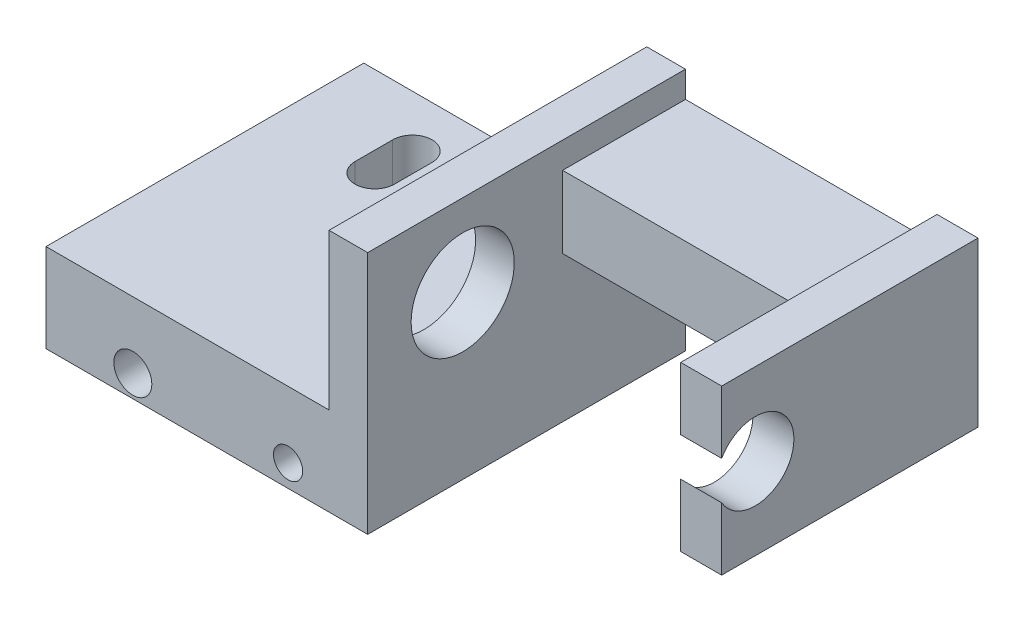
ISO-10303-21;
HEADER;
FILE_DESCRIPTION(('STEP AP214'),'2;1');
FILE_NAME('part.step','',(''),(''),'','','');
FILE_SCHEMA(('AUTOMOTIVE_DESIGN { 1 0 10303 214 1 1 1 1 }'));
ENDSEC;
DATA;
#1=APPLICATION_CONTEXT('core data for automotive mechanical design processes');
#2=APPLICATION_PROTOCOL_DEFINITION('international standard','automotive_design',2000,#1);
#3=PRODUCT_CONTEXT('',#1,'mechanical');
#4=PRODUCT('Part','Part','',(#3));
#5=PRODUCT_RELATED_PRODUCT_CATEGORY('part','',(#4));
#6=PRODUCT_DEFINITION_FORMATION('','',#4);
#7=PRODUCT_DEFINITION_CONTEXT('part definition',#1,'design');
#8=PRODUCT_DEFINITION('design','',#6,#7);
#9=PRODUCT_DEFINITION_SHAPE('','',#8);
#10=(LENGTH_UNIT() NAMED_UNIT(*) SI_UNIT(.MILLI.,.METRE.));
#11=(NAMED_UNIT(*) PLANE_ANGLE_UNIT() SI_UNIT($,.RADIAN.));
#12=(NAMED_UNIT(*) SI_UNIT($,.STERADIAN.) SOLID_ANGLE_UNIT());
#13=UNCERTAINTY_MEASURE_WITH_UNIT(LENGTH_MEASURE(1.E-05),#10,'distance_accuracy_value','');
#14=(GEOMETRIC_REPRESENTATION_CONTEXT(3) GLOBAL_UNCERTAINTY_ASSIGNED_CONTEXT((#13)) GLOBAL_UNIT_ASSIGNED_CONTEXT((#10,
#11,#12)) REPRESENTATION_CONTEXT('',''));
#15=CARTESIAN_POINT('',(0.,0.,0.));
#16=DIRECTION('',(0.,0.,1.));
#17=DIRECTION('',(1.,0.,0.));
#18=AXIS2_PLACEMENT_3D('',#15,#16,#17);
#19=CARTESIAN_POINT('',(-23.8125,18.923,12.319));
#20=DIRECTION('',(0.,1.,0.));
#21=DIRECTION('',(0.,0.,1.));
#22=AXIS2_PLACEMENT_3D('',#19,#20,#21);
#23=PLANE('',#22);
#24=DIRECTION('',(0.,0.,-1.));
#25=VECTOR('',#24,1.);
#26=CARTESIAN_POINT('',(-1.86690000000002,18.923,-12.319));
#27=LINE('',#26,#25);
#28=CARTESIAN_POINT('',(-1.86689999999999,18.9230000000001,12.319));
#29=VERTEX_POINT('',#28);
#30=CARTESIAN_POINT('',(-1.86690000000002,18.923,-12.319));
#31=VERTEX_POINT('',#30);
#32=EDGE_CURVE('E451',#29,#31,#27,.T.);
#33=ORIENTED_EDGE('',*,*,#32,.F.);
#34=DIRECTION('',(1.,0.,0.));
#35=VECTOR('',#34,1.);
#36=CARTESIAN_POINT('',(-23.8125,18.923,12.319));
#37=LINE('',#36,#35);
#38=CARTESIAN_POINT('',(1.13029999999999,18.923,12.319));
#39=VERTEX_POINT('',#38);
#40=EDGE_CURVE('E338',#29,#39,#37,.T.);
#41=ORIENTED_EDGE('',*,*,#40,.T.);
#42=DIRECTION('',(0.,0.,1.));
#43=VECTOR('',#42,1.);
#44=CARTESIAN_POINT('',(1.13029999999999,18.923,12.319));
#45=LINE('',#44,#43);
#46=CARTESIAN_POINT('',(1.13029999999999,18.923,-12.319));
#47=VERTEX_POINT('',#46);
#48=EDGE_CURVE('E600',#47,#39,#45,.T.);
#49=ORIENTED_EDGE('',*,*,#48,.F.);
#50=DIRECTION('',(-1.,0.,0.));
#51=VECTOR('',#50,1.);
#52=CARTESIAN_POINT('',(-23.8125,18.923,-12.319));
#53=LINE('',#52,#51);
#54=EDGE_CURVE('E628',#47,#31,#53,.T.);
#55=ORIENTED_EDGE('',*,*,#54,.T.);
#56=EDGE_LOOP('',(#33,#41,#49,#55));
#57=FACE_BOUND('',#56,.T.);
#58=ADVANCED_FACE('F44',(#57),#23,.T.);
#59=CARTESIAN_POINT('',(-23.8125,18.923,12.319));
#60=DIRECTION('',(0.,0.,-1.));
#61=DIRECTION('',(-1.,0.,0.));
#62=AXIS2_PLACEMENT_3D('',#59,#60,#61);
#63=PLANE('',#62);
#64=CARTESIAN_POINT('',(-17.0815,1.71450000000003,12.319));
#65=DIRECTION('',(0.,0.,1.));
#66=DIRECTION('',(1.,0.,0.));
#67=AXIS2_PLACEMENT_3D('',#64,#65,#66);
#68=CIRCLE('',#67,1.47319999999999);
#69=CARTESIAN_POINT('',(-15.6083,1.71450000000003,12.319));
#70=VERTEX_POINT('',#69);
#71=EDGE_CURVE('E387',#70,#70,#68,.T.);
#72=ORIENTED_EDGE('',*,*,#71,.F.);
#73=EDGE_LOOP('',(#72));
#74=FACE_BOUND('',#73,.T.);
#75=CARTESIAN_POINT('',(-5.04189999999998,1.7145,12.319));
#76=DIRECTION('',(0.,0.,1.));
#77=DIRECTION('',(1.,0.,0.));
#78=AXIS2_PLACEMENT_3D('',#75,#76,#77);
#79=CIRCLE('',#78,1.13029999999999);
#80=CARTESIAN_POINT('',(-3.9116,1.7145,12.319));
#81=VERTEX_POINT('',#80);
#82=EDGE_CURVE('E395',#81,#81,#79,.T.);
#83=ORIENTED_EDGE('',*,*,#82,.F.);
#84=EDGE_LOOP('',(#83));
#85=FACE_BOUND('',#84,.T.);
#86=ORIENTED_EDGE('',*,*,#40,.F.);
#87=DIRECTION('',(0.,-1.,0.));
#88=VECTOR('',#87,1.);
#89=CARTESIAN_POINT('',(-1.86689999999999,18.9230000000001,12.319));
#90=LINE('',#89,#88);
#91=CARTESIAN_POINT('',(-1.8669,6.85800000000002,12.319));
#92=VERTEX_POINT('',#91);
#93=EDGE_CURVE('E319',#29,#92,#90,.T.);
#94=ORIENTED_EDGE('',*,*,#93,.T.);
#95=DIRECTION('',(-1.,0.,0.));
#96=VECTOR('',#95,1.);
#97=CARTESIAN_POINT('',(-1.8669,6.85800000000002,12.319));
#98=LINE('',#97,#96);
#99=CARTESIAN_POINT('',(-23.8125,6.85800000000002,12.319));
#100=VERTEX_POINT('',#99);
#101=EDGE_CURVE('E327',#92,#100,#98,.T.);
#102=ORIENTED_EDGE('',*,*,#101,.T.);
#103=DIRECTION('',(0.,-1.,0.));
#104=VECTOR('',#103,1.);
#105=CARTESIAN_POINT('',(-23.8125,18.923,12.319));
#106=LINE('',#105,#104);
#107=CARTESIAN_POINT('',(-23.8125,0.,12.319));
#108=VERTEX_POINT('',#107);
#109=EDGE_CURVE('E651',#100,#108,#106,.T.);
#110=ORIENTED_EDGE('',*,*,#109,.T.);
#111=DIRECTION('',(1.,0.,0.));
#112=VECTOR('',#111,1.);
#113=CARTESIAN_POINT('',(-23.8125,0.,12.319));
#114=LINE('',#113,#112);
#115=CARTESIAN_POINT('',(1.13030000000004,0.,12.319));
#116=VERTEX_POINT('',#115);
#117=EDGE_CURVE('E637',#108,#116,#114,.T.);
#118=ORIENTED_EDGE('',*,*,#117,.T.);
#119=DIRECTION('',(0.,1.,0.));
#120=VECTOR('',#119,1.);
#121=CARTESIAN_POINT('',(1.13030000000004,0.,12.319));
#122=LINE('',#121,#120);
#123=EDGE_CURVE('E604',#116,#39,#122,.T.);
#124=ORIENTED_EDGE('',*,*,#123,.T.);
#125=EDGE_LOOP('',(#86,#94,#102,#110,#118,#124));
#126=FACE_BOUND('',#125,.T.);
#127=ADVANCED_FACE('F336',(#74,#85,#126),#63,.F.);
#128=CARTESIAN_POINT('',(-23.8125,18.923,-12.319));
#129=DIRECTION('',(1.,0.,0.));
#130=DIRECTION('',(0.,0.,-1.));
#131=AXIS2_PLACEMENT_3D('',#128,#129,#130);
#132=PLANE('',#131);
#133=ORIENTED_EDGE('',*,*,#109,.F.);
#134=DIRECTION('',(0.,0.,-1.));
#135=VECTOR('',#134,1.);
#136=CARTESIAN_POINT('',(-23.8125,6.85800000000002,12.319));
#137=LINE('',#136,#135);
#138=CARTESIAN_POINT('',(-23.8125,6.858,-12.319));
#139=VERTEX_POINT('',#138);
#140=EDGE_CURVE('E326',#100,#139,#137,.T.);
#141=ORIENTED_EDGE('',*,*,#140,.T.);
#142=DIRECTION('',(0.,-1.,0.));
#143=VECTOR('',#142,1.);
#144=CARTESIAN_POINT('',(-23.8125,18.923,-12.319));
#145=LINE('',#144,#143);
#146=CARTESIAN_POINT('',(-23.8125,0.,-12.319));
#147=VERTEX_POINT('',#146);
#148=EDGE_CURVE('E633',#139,#147,#145,.T.);
#149=ORIENTED_EDGE('',*,*,#148,.T.);
#150=DIRECTION('',(0.,0.,1.));
#151=VECTOR('',#150,1.);
#152=CARTESIAN_POINT('',(-23.8125,0.,-12.319));
#153=LINE('',#152,#151);
#154=EDGE_CURVE('E615',#147,#108,#153,.T.);
#155=ORIENTED_EDGE('',*,*,#154,.T.);
#156=EDGE_LOOP('',(#133,#141,#149,#155));
#157=FACE_BOUND('',#156,.T.);
#158=ADVANCED_FACE('F46',(#157),#132,.F.);
#159=CARTESIAN_POINT('',(23.8125,18.923,-12.319));
#160=DIRECTION('',(-1.,0.,0.));
#161=DIRECTION('',(0.,0.,1.));
#162=AXIS2_PLACEMENT_3D('',#159,#160,#161);
#163=PLANE('',#162);
#164=DIRECTION('',(0.,0.,-1.));
#165=VECTOR('',#164,1.);
#166=CARTESIAN_POINT('',(23.8125,18.923,-12.319));
#167=LINE('',#166,#165);
#168=CARTESIAN_POINT('',(23.8125,18.923,7.55650000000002));
#169=VERTEX_POINT('',#168);
#170=CARTESIAN_POINT('',(23.8125,18.923,-12.319));
#171=VERTEX_POINT('',#170);
#172=EDGE_CURVE('E624',#169,#171,#167,.T.);
#173=ORIENTED_EDGE('',*,*,#172,.F.);
#174=DIRECTION('',(0.,1.,0.));
#175=VECTOR('',#174,1.);
#176=CARTESIAN_POINT('',(23.8125,19.1150373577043,7.5565));
#177=LINE('',#176,#175);
#178=CARTESIAN_POINT('',(23.8125,14.0630428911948,7.55649999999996));
#179=VERTEX_POINT('',#178);
#180=EDGE_CURVE('E371',#179,#169,#177,.T.);
#181=ORIENTED_EDGE('',*,*,#180,.F.);
#182=CARTESIAN_POINT('',(23.8125,12.573,4.95299999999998));
#183=DIRECTION('',(1.,0.,0.));
#184=DIRECTION('',(0.,0.,-1.));
#185=AXIS2_PLACEMENT_3D('',#182,#183,#184);
#186=CIRCLE('',#185,2.99974);
#187=CARTESIAN_POINT('',(23.8125,11.0829571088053,7.55649999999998));
#188=VERTEX_POINT('',#187);
#189=EDGE_CURVE('E476',#188,#179,#186,.T.);
#190=ORIENTED_EDGE('',*,*,#189,.F.);
#191=CARTESIAN_POINT('',(23.8125,6.22300000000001,7.55650000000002));
#192=VERTEX_POINT('',#191);
#193=EDGE_CURVE('E377',#192,#188,#177,.T.);
#194=ORIENTED_EDGE('',*,*,#193,.F.);
#195=DIRECTION('',(0.,0.,-1.));
#196=VECTOR('',#195,1.);
#197=CARTESIAN_POINT('',(23.8125,6.22300000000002,12.319));
#198=LINE('',#197,#196);
#199=CARTESIAN_POINT('',(23.8125,6.22300000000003,-12.319));
#200=VERTEX_POINT('',#199);
#201=EDGE_CURVE('E585',#192,#200,#198,.T.);
#202=ORIENTED_EDGE('',*,*,#201,.T.);
#203=DIRECTION('',(0.,-1.,0.));
#204=VECTOR('',#203,1.);
#205=CARTESIAN_POINT('',(23.8125,18.923,-12.319));
#206=LINE('',#205,#204);
#207=EDGE_CURVE('E647',#171,#200,#206,.T.);
#208=ORIENTED_EDGE('',*,*,#207,.F.);
#209=EDGE_LOOP('',(#173,#181,#190,#194,#202,#208));
#210=FACE_BOUND('',#209,.T.);
#211=ADVANCED_FACE('F762',(#210),#163,.F.);
#212=CARTESIAN_POINT('',(-23.8125,18.923,-12.319));
#213=DIRECTION('',(0.,0.,1.));
#214=DIRECTION('',(1.,0.,0.));
#215=AXIS2_PLACEMENT_3D('',#212,#213,#214);
#216=PLANE('',#215);
#217=DIRECTION('',(-1.,0.,0.));
#218=VECTOR('',#217,1.);
#219=CARTESIAN_POINT('',(-1.86689999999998,6.85799999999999,-12.319));
#220=LINE('',#219,#218);
#221=CARTESIAN_POINT('',(-1.86689999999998,6.85799999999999,-12.319));
#222=VERTEX_POINT('',#221);
#223=EDGE_CURVE('E340',#222,#139,#220,.T.);
#224=ORIENTED_EDGE('',*,*,#223,.F.);
#225=DIRECTION('',(0.,1.,0.));
#226=VECTOR('',#225,1.);
#227=CARTESIAN_POINT('',(-1.8669,8.76300000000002,-12.319));
#228=LINE('',#227,#226);
#229=EDGE_CURVE('E322',#222,#31,#228,.T.);
#230=ORIENTED_EDGE('',*,*,#229,.T.);
#231=ORIENTED_EDGE('',*,*,#54,.F.);
#232=DIRECTION('',(0.,1.,0.));
#233=VECTOR('',#232,1.);
#234=CARTESIAN_POINT('',(1.13029999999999,18.923,-12.319));
#235=LINE('',#234,#233);
#236=CARTESIAN_POINT('',(1.13029999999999,16.891,-12.319));
#237=VERTEX_POINT('',#236);
#238=EDGE_CURVE('E527',#237,#47,#235,.T.);
#239=ORIENTED_EDGE('',*,*,#238,.F.);
#240=DIRECTION('',(-1.,0.,0.));
#241=VECTOR('',#240,1.);
#242=CARTESIAN_POINT('',(1.13029999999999,16.891,-12.319));
#243=LINE('',#242,#241);
#244=CARTESIAN_POINT('',(20.6375,16.891,-12.319));
#245=VERTEX_POINT('',#244);
#246=EDGE_CURVE('E554',#245,#237,#243,.T.);
#247=ORIENTED_EDGE('',*,*,#246,.F.);
#248=DIRECTION('',(0.,-1.,0.));
#249=VECTOR('',#248,1.);
#250=CARTESIAN_POINT('',(20.6375,18.923,-12.319));
#251=LINE('',#250,#249);
#252=CARTESIAN_POINT('',(20.6375,18.923,-12.319));
#253=VERTEX_POINT('',#252);
#254=EDGE_CURVE('E550',#253,#245,#251,.T.);
#255=ORIENTED_EDGE('',*,*,#254,.F.);
#256=EDGE_CURVE('E629',#171,#253,#53,.T.);
#257=ORIENTED_EDGE('',*,*,#256,.F.);
#258=ORIENTED_EDGE('',*,*,#207,.T.);
#259=DIRECTION('',(1.,0.,0.));
#260=VECTOR('',#259,1.);
#261=CARTESIAN_POINT('',(20.6375,6.22300000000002,-12.319));
#262=LINE('',#261,#260);
#263=CARTESIAN_POINT('',(20.6375,6.22300000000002,-12.319));
#264=VERTEX_POINT('',#263);
#265=EDGE_CURVE('E580',#264,#200,#262,.T.);
#266=ORIENTED_EDGE('',*,*,#265,.F.);
#267=DIRECTION('',(0.,-1.,0.));
#268=VECTOR('',#267,1.);
#269=CARTESIAN_POINT('',(20.6375,6.22300000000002,-12.319));
#270=LINE('',#269,#268);
#271=CARTESIAN_POINT('',(20.6375,11.303,-12.319));
#272=VERTEX_POINT('',#271);
#273=EDGE_CURVE('E576',#272,#264,#270,.T.);
#274=ORIENTED_EDGE('',*,*,#273,.F.);
#275=DIRECTION('',(1.,0.,0.));
#276=VECTOR('',#275,1.);
#277=CARTESIAN_POINT('',(1.1303,11.303,-12.319));
#278=LINE('',#277,#276);
#279=CARTESIAN_POINT('',(1.1303,11.303,-12.319));
#280=VERTEX_POINT('',#279);
#281=EDGE_CURVE('E572',#280,#272,#278,.T.);
#282=ORIENTED_EDGE('',*,*,#281,.F.);
#283=DIRECTION('',(0.,1.,0.));
#284=VECTOR('',#283,1.);
#285=CARTESIAN_POINT('',(1.13030000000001,0.,-12.319));
#286=LINE('',#285,#284);
#287=CARTESIAN_POINT('',(1.13030000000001,0.,-12.319));
#288=VERTEX_POINT('',#287);
#289=EDGE_CURVE('E568',#288,#280,#286,.T.);
#290=ORIENTED_EDGE('',*,*,#289,.F.);
#291=DIRECTION('',(-1.,0.,0.));
#292=VECTOR('',#291,1.);
#293=CARTESIAN_POINT('',(-23.8125,0.,-12.319));
#294=LINE('',#293,#292);
#295=CARTESIAN_POINT('',(-1.8669,0.,-12.319));
#296=VERTEX_POINT('',#295);
#297=EDGE_CURVE('E625',#288,#296,#294,.T.);
#298=ORIENTED_EDGE('',*,*,#297,.T.);
#299=DIRECTION('',(0.,-1.,0.));
#300=VECTOR('',#299,1.);
#301=CARTESIAN_POINT('',(-1.86689999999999,3.429,-12.319));
#302=LINE('',#301,#300);
#303=CARTESIAN_POINT('',(-1.86689999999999,3.429,-12.319));
#304=VERTEX_POINT('',#303);
#305=EDGE_CURVE('E541',#304,#296,#302,.T.);
#306=ORIENTED_EDGE('',*,*,#305,.F.);
#307=DIRECTION('',(1.,0.,0.));
#308=VECTOR('',#307,1.);
#309=CARTESIAN_POINT('',(-20.2565,3.42900000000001,-12.319));
#310=LINE('',#309,#308);
#311=CARTESIAN_POINT('',(-20.2565,3.42900000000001,-12.319));
#312=VERTEX_POINT('',#311);
#313=EDGE_CURVE('E485',#312,#304,#310,.T.);
#314=ORIENTED_EDGE('',*,*,#313,.F.);
#315=DIRECTION('',(0.,-1.,0.));
#316=VECTOR('',#315,1.);
#317=CARTESIAN_POINT('',(-20.2565,3.42900000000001,-12.319));
#318=LINE('',#317,#316);
#319=CARTESIAN_POINT('',(-20.2565,0.,-12.319));
#320=VERTEX_POINT('',#319);
#321=EDGE_CURVE('E506',#312,#320,#318,.T.);
#322=ORIENTED_EDGE('',*,*,#321,.T.);
#323=EDGE_CURVE('E641',#320,#147,#294,.T.);
#324=ORIENTED_EDGE('',*,*,#323,.T.);
#325=ORIENTED_EDGE('',*,*,#148,.F.);
#326=EDGE_LOOP('',(#224,#230,#231,#239,#247,#255,#257,#258,#266,#274,#282,#290,#298,#306,#314,
#322,#324,#325));
#327=FACE_BOUND('',#326,.T.);
#328=ADVANCED_FACE('F754',(#327),#216,.F.);
#329=DIRECTION('',(-1.,0.,0.));
#330=VECTOR('',#329,1.);
#331=CARTESIAN_POINT('',(-23.8125,18.923,7.55649999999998));
#332=LINE('',#331,#330);
#333=CARTESIAN_POINT('',(20.6375,18.923,7.55649999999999));
#334=VERTEX_POINT('',#333);
#335=EDGE_CURVE('E384',#169,#334,#332,.T.);
#336=ORIENTED_EDGE('',*,*,#335,.F.);
#337=ORIENTED_EDGE('',*,*,#172,.T.);
#338=ORIENTED_EDGE('',*,*,#256,.T.);
#339=DIRECTION('',(0.,0.,-1.));
#340=VECTOR('',#339,1.);
#341=CARTESIAN_POINT('',(20.6375,18.923,12.319));
#342=LINE('',#341,#340);
#343=EDGE_CURVE('E605',#334,#253,#342,.T.);
#344=ORIENTED_EDGE('',*,*,#343,.F.);
#345=EDGE_LOOP('',(#336,#337,#338,#344));
#346=FACE_BOUND('',#345,.T.);
#347=ADVANCED_FACE('F745',(#346),#23,.T.);
#348=CARTESIAN_POINT('',(-23.8125,0.,12.319));
#349=DIRECTION('',(0.,1.,0.));
#350=DIRECTION('',(0.,0.,1.));
#351=AXIS2_PLACEMENT_3D('',#348,#349,#350);
#352=PLANE('',#351);
#353=ORIENTED_EDGE('',*,*,#323,.F.);
#354=DIRECTION('',(0.,0.,-1.));
#355=VECTOR('',#354,1.);
#356=CARTESIAN_POINT('',(-20.2565,0.,-12.319));
#357=LINE('',#356,#355);
#358=CARTESIAN_POINT('',(-20.2565,0.,-1.34620000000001));
#359=VERTEX_POINT('',#358);
#360=EDGE_CURVE('E480',#359,#320,#357,.T.);
#361=ORIENTED_EDGE('',*,*,#360,.F.);
#362=CARTESIAN_POINT('',(-17.0815,0.,-1.34620000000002));
#363=DIRECTION('',(0.,-1.,0.));
#364=DIRECTION('',(0.,0.,1.));
#365=AXIS2_PLACEMENT_3D('',#362,#363,#364);
#366=CIRCLE('',#365,3.175);
#367=CARTESIAN_POINT('',(-17.0815,0.,1.8288));
#368=VERTEX_POINT('',#367);
#369=EDGE_CURVE('E486',#368,#359,#366,.T.);
#370=ORIENTED_EDGE('',*,*,#369,.F.);
#371=DIRECTION('',(-1.,0.,0.));
#372=VECTOR('',#371,1.);
#373=CARTESIAN_POINT('',(-17.0815,0.,1.8288));
#374=LINE('',#373,#372);
#375=CARTESIAN_POINT('',(-5.04189999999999,0.,1.8288));
#376=VERTEX_POINT('',#375);
#377=EDGE_CURVE('E517',#376,#368,#374,.T.);
#378=ORIENTED_EDGE('',*,*,#377,.F.);
#379=CARTESIAN_POINT('',(-5.04189999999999,0.,-1.3462));
#380=DIRECTION('',(0.,-1.,0.));
#381=DIRECTION('',(0.,0.,1.));
#382=AXIS2_PLACEMENT_3D('',#379,#380,#381);
#383=CIRCLE('',#382,3.175);
#384=CARTESIAN_POINT('',(-1.86689999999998,0.,-1.3462));
#385=VERTEX_POINT('',#384);
#386=EDGE_CURVE('E513',#385,#376,#383,.T.);
#387=ORIENTED_EDGE('',*,*,#386,.F.);
#388=DIRECTION('',(0.,0.,1.));
#389=VECTOR('',#388,1.);
#390=CARTESIAN_POINT('',(-1.8669,0.,-12.319));
#391=LINE('',#390,#389);
#392=EDGE_CURVE('E509',#296,#385,#391,.T.);
#393=ORIENTED_EDGE('',*,*,#392,.F.);
#394=ORIENTED_EDGE('',*,*,#297,.F.);
#395=DIRECTION('',(0.,0.,1.));
#396=VECTOR('',#395,1.);
#397=CARTESIAN_POINT('',(1.13030000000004,0.,12.319));
#398=LINE('',#397,#396);
#399=EDGE_CURVE('E601',#288,#116,#398,.T.);
#400=ORIENTED_EDGE('',*,*,#399,.T.);
#401=ORIENTED_EDGE('',*,*,#117,.F.);
#402=ORIENTED_EDGE('',*,*,#154,.F.);
#403=EDGE_LOOP('',(#353,#361,#370,#378,#387,#393,#394,#400,#401,#402));
#404=FACE_BOUND('',#403,.T.);
#405=ADVANCED_FACE('F753',(#404),#352,.F.);
#406=CARTESIAN_POINT('',(1.13030000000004,0.,12.319));
#407=DIRECTION('',(-1.,0.,0.));
#408=DIRECTION('',(0.,0.,1.));
#409=AXIS2_PLACEMENT_3D('',#406,#407,#408);
#410=PLANE('',#409);
#411=CARTESIAN_POINT('',(1.13029999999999,12.573,4.95299999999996));
#412=DIRECTION('',(-1.,0.,0.));
#413=DIRECTION('',(0.,0.,1.));
#414=AXIS2_PLACEMENT_3D('',#411,#412,#413);
#415=CIRCLE('',#414,3.99999999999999);
#416=CARTESIAN_POINT('',(1.13029999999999,12.573,8.95299999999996));
#417=VERTEX_POINT('',#416);
#418=EDGE_CURVE('E468',#417,#417,#415,.T.);
#419=ORIENTED_EDGE('',*,*,#418,.T.);
#420=EDGE_LOOP('',(#419));
#421=FACE_BOUND('',#420,.T.);
#422=DIRECTION('',(0.,1.,0.));
#423=VECTOR('',#422,1.);
#424=CARTESIAN_POINT('',(1.13029999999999,0.,-2.79400000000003));
#425=LINE('',#424,#423);
#426=CARTESIAN_POINT('',(1.13029999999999,11.303,-2.79399999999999));
#427=VERTEX_POINT('',#426);
#428=CARTESIAN_POINT('',(1.13029999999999,16.8910000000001,-2.79400000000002));
#429=VERTEX_POINT('',#428);
#430=EDGE_CURVE('E611',#427,#429,#425,.T.);
#431=ORIENTED_EDGE('',*,*,#430,.T.);
#432=DIRECTION('',(0.,0.,-1.));
#433=VECTOR('',#432,1.);
#434=CARTESIAN_POINT('',(1.1303,16.891,12.319));
#435=LINE('',#434,#433);
#436=EDGE_CURVE('E559',#429,#237,#435,.T.);
#437=ORIENTED_EDGE('',*,*,#436,.T.);
#438=ORIENTED_EDGE('',*,*,#238,.T.);
#439=ORIENTED_EDGE('',*,*,#48,.T.);
#440=ORIENTED_EDGE('',*,*,#123,.F.);
#441=ORIENTED_EDGE('',*,*,#399,.F.);
#442=ORIENTED_EDGE('',*,*,#289,.T.);
#443=DIRECTION('',(0.,0.,-1.));
#444=VECTOR('',#443,1.);
#445=CARTESIAN_POINT('',(1.13029999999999,11.303,12.319));
#446=LINE('',#445,#444);
#447=EDGE_CURVE('E584',#427,#280,#446,.T.);
#448=ORIENTED_EDGE('',*,*,#447,.F.);
#449=EDGE_LOOP('',(#431,#437,#438,#439,#440,#441,#442,#448));
#450=FACE_BOUND('',#449,.T.);
#451=ADVANCED_FACE('F760',(#421,#450),#410,.F.);
#452=CARTESIAN_POINT('',(1.13029999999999,0.,-2.79400000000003));
#453=DIRECTION('',(0.,0.,-1.));
#454=DIRECTION('',(-1.,0.,0.));
#455=AXIS2_PLACEMENT_3D('',#452,#453,#454);
#456=PLANE('',#455);
#457=DIRECTION('',(0.,1.,0.));
#458=VECTOR('',#457,1.);
#459=CARTESIAN_POINT('',(20.6375,0.,-2.79400000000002));
#460=LINE('',#459,#458);
#461=CARTESIAN_POINT('',(20.6375,11.303,-2.79399999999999));
#462=VERTEX_POINT('',#461);
#463=CARTESIAN_POINT('',(20.6375,16.8910000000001,-2.79400000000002));
#464=VERTEX_POINT('',#463);
#465=EDGE_CURVE('E616',#462,#464,#460,.T.);
#466=ORIENTED_EDGE('',*,*,#465,.T.);
#467=DIRECTION('',(-1.,0.,0.));
#468=VECTOR('',#467,1.);
#469=CARTESIAN_POINT('',(1.13029999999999,16.8910000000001,-2.79400000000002));
#470=LINE('',#469,#468);
#471=EDGE_CURVE('E562',#464,#429,#470,.T.);
#472=ORIENTED_EDGE('',*,*,#471,.T.);
#473=ORIENTED_EDGE('',*,*,#430,.F.);
#474=DIRECTION('',(1.,0.,0.));
#475=VECTOR('',#474,1.);
#476=CARTESIAN_POINT('',(1.13029999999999,11.303,-2.79399999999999));
#477=LINE('',#476,#475);
#478=EDGE_CURVE('E588',#427,#462,#477,.T.);
#479=ORIENTED_EDGE('',*,*,#478,.T.);
#480=EDGE_LOOP('',(#466,#472,#473,#479));
#481=FACE_BOUND('',#480,.T.);
#482=ADVANCED_FACE('F818',(#481),#456,.F.);
#483=CARTESIAN_POINT('',(20.6375,0.,12.319));
#484=DIRECTION('',(1.,0.,0.));
#485=DIRECTION('',(0.,0.,-1.));
#486=AXIS2_PLACEMENT_3D('',#483,#484,#485);
#487=PLANE('',#486);
#488=DIRECTION('',(0.,0.,-1.));
#489=VECTOR('',#488,1.);
#490=CARTESIAN_POINT('',(20.6375,6.22300000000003,12.319));
#491=LINE('',#490,#489);
#492=CARTESIAN_POINT('',(20.6375,6.22300000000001,7.55649999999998));
#493=VERTEX_POINT('',#492);
#494=EDGE_CURVE('E589',#493,#264,#491,.T.);
#495=ORIENTED_EDGE('',*,*,#494,.F.);
#496=DIRECTION('',(0.,1.,0.));
#497=VECTOR('',#496,1.);
#498=CARTESIAN_POINT('',(20.6375,19.1150373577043,7.55649999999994));
#499=LINE('',#498,#497);
#500=CARTESIAN_POINT('',(20.6375,11.0829571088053,7.55649999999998));
#501=VERTEX_POINT('',#500);
#502=EDGE_CURVE('E376',#493,#501,#499,.T.);
#503=ORIENTED_EDGE('',*,*,#502,.T.);
#504=CARTESIAN_POINT('',(20.6375,12.573,4.95300000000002));
#505=DIRECTION('',(1.,0.,0.));
#506=DIRECTION('',(0.,0.,-1.));
#507=AXIS2_PLACEMENT_3D('',#504,#505,#506);
#508=CIRCLE('',#507,2.99974);
#509=CARTESIAN_POINT('',(20.6375,14.0630428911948,7.55649999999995));
#510=VERTEX_POINT('',#509);
#511=EDGE_CURVE('E472',#510,#501,#508,.F.);
#512=ORIENTED_EDGE('',*,*,#511,.F.);
#513=EDGE_CURVE('E372',#510,#334,#499,.T.);
#514=ORIENTED_EDGE('',*,*,#513,.T.);
#515=ORIENTED_EDGE('',*,*,#343,.T.);
#516=ORIENTED_EDGE('',*,*,#254,.T.);
#517=DIRECTION('',(0.,0.,-1.));
#518=VECTOR('',#517,1.);
#519=CARTESIAN_POINT('',(20.6375,16.891,12.319));
#520=LINE('',#519,#518);
#521=EDGE_CURVE('E558',#464,#245,#520,.T.);
#522=ORIENTED_EDGE('',*,*,#521,.F.);
#523=ORIENTED_EDGE('',*,*,#465,.F.);
#524=DIRECTION('',(0.,0.,-1.));
#525=VECTOR('',#524,1.);
#526=CARTESIAN_POINT('',(20.6375,11.3030000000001,12.319));
#527=LINE('',#526,#525);
#528=EDGE_CURVE('E592',#462,#272,#527,.T.);
#529=ORIENTED_EDGE('',*,*,#528,.T.);
#530=ORIENTED_EDGE('',*,*,#273,.T.);
#531=EDGE_LOOP('',(#495,#503,#512,#514,#515,#516,#522,#523,#529,#530));
#532=FACE_BOUND('',#531,.T.);
#533=ADVANCED_FACE('F782',(#532),#487,.F.);
#534=CARTESIAN_POINT('',(1.13029999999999,11.303,12.319));
#535=DIRECTION('',(0.,1.,0.));
#536=DIRECTION('',(-1.,0.,0.));
#537=AXIS2_PLACEMENT_3D('',#534,#535,#536);
#538=PLANE('',#537);
#539=ORIENTED_EDGE('',*,*,#447,.T.);
#540=ORIENTED_EDGE('',*,*,#281,.T.);
#541=ORIENTED_EDGE('',*,*,#528,.F.);
#542=ORIENTED_EDGE('',*,*,#478,.F.);
#543=EDGE_LOOP('',(#539,#540,#541,#542));
#544=FACE_BOUND('',#543,.T.);
#545=ADVANCED_FACE('F822',(#544),#538,.F.);
#546=CARTESIAN_POINT('',(20.6375,6.22300000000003,12.319));
#547=DIRECTION('',(0.,1.,0.));
#548=DIRECTION('',(0.,0.,1.));
#549=AXIS2_PLACEMENT_3D('',#546,#547,#548);
#550=PLANE('',#549);
#551=ORIENTED_EDGE('',*,*,#201,.F.);
#552=DIRECTION('',(-1.,0.,0.));
#553=VECTOR('',#552,1.);
#554=CARTESIAN_POINT('',(20.6375,6.22300000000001,7.55649999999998));
#555=LINE('',#554,#553);
#556=EDGE_CURVE('E380',#192,#493,#555,.T.);
#557=ORIENTED_EDGE('',*,*,#556,.T.);
#558=ORIENTED_EDGE('',*,*,#494,.T.);
#559=ORIENTED_EDGE('',*,*,#265,.T.);
#560=EDGE_LOOP('',(#551,#557,#558,#559));
#561=FACE_BOUND('',#560,.T.);
#562=ADVANCED_FACE('F825',(#561),#550,.F.);
#563=CARTESIAN_POINT('',(1.1303,16.891,12.319));
#564=DIRECTION('',(0.,-1.,0.));
#565=DIRECTION('',(1.,0.,0.));
#566=AXIS2_PLACEMENT_3D('',#563,#564,#565);
#567=PLANE('',#566);
#568=ORIENTED_EDGE('',*,*,#521,.T.);
#569=ORIENTED_EDGE('',*,*,#246,.T.);
#570=ORIENTED_EDGE('',*,*,#436,.F.);
#571=ORIENTED_EDGE('',*,*,#471,.F.);
#572=EDGE_LOOP('',(#568,#569,#570,#571));
#573=FACE_BOUND('',#572,.T.);
#574=ADVANCED_FACE('F816',(#573),#567,.F.);
#575=CARTESIAN_POINT('',(-20.2565,3.42900000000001,-12.319));
#576=DIRECTION('',(-1.,0.,0.));
#577=DIRECTION('',(0.,0.,1.));
#578=AXIS2_PLACEMENT_3D('',#575,#576,#577);
#579=PLANE('',#578);
#580=ORIENTED_EDGE('',*,*,#360,.T.);
#581=ORIENTED_EDGE('',*,*,#321,.F.);
#582=DIRECTION('',(0.,0.,-1.));
#583=VECTOR('',#582,1.);
#584=CARTESIAN_POINT('',(-20.2565,3.42900000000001,-12.319));
#585=LINE('',#584,#583);
#586=CARTESIAN_POINT('',(-20.2565,3.42900000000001,-1.34620000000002));
#587=VERTEX_POINT('',#586);
#588=EDGE_CURVE('E481',#587,#312,#585,.T.);
#589=ORIENTED_EDGE('',*,*,#588,.F.);
#590=DIRECTION('',(0.,-1.,0.));
#591=VECTOR('',#590,1.);
#592=CARTESIAN_POINT('',(-20.2565,3.42900000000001,-1.34620000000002));
#593=LINE('',#592,#591);
#594=EDGE_CURVE('E524',#587,#359,#593,.T.);
#595=ORIENTED_EDGE('',*,*,#594,.T.);
#596=EDGE_LOOP('',(#580,#581,#589,#595));
#597=FACE_BOUND('',#596,.T.);
#598=ADVANCED_FACE('F733',(#597),#579,.F.);
#599=CARTESIAN_POINT('',(-17.0815,3.42900000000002,-1.34620000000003));
#600=DIRECTION('',(0.,-1.,0.));
#601=DIRECTION('',(0.,0.,-1.));
#602=AXIS2_PLACEMENT_3D('',#599,#600,#601);
#603=CYLINDRICAL_SURFACE('',#602,3.175);
#604=DIRECTION('',(0.,-1.,0.));
#605=VECTOR('',#604,1.);
#606=CARTESIAN_POINT('',(-17.0815,3.42900000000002,1.8288));
#607=LINE('',#606,#605);
#608=CARTESIAN_POINT('',(-17.0815,3.42900000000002,1.8288));
#609=VERTEX_POINT('',#608);
#610=CARTESIAN_POINT('',(-17.0815,3.18770000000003,1.82879999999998));
#611=VERTEX_POINT('',#610);
#612=EDGE_CURVE('E528',#609,#611,#607,.T.);
#613=ORIENTED_EDGE('',*,*,#612,.T.);
#614=CARTESIAN_POINT('',(-17.0815,3.18770000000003,1.82879999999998));
#615=CARTESIAN_POINT('',(-17.1207314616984,3.18770181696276,1.82880379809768));
#616=CARTESIAN_POINT('',(-17.1599423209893,3.18613183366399,1.82807204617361));
#617=CARTESIAN_POINT('',(-17.2380482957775,3.179882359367,1.82517838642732));
#618=CARTESIAN_POINT('',(-17.2769435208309,3.17520399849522,1.82301699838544));
#619=CARTESIAN_POINT('',(-17.392400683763,3.15661792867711,1.81447751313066));
#620=CARTESIAN_POINT('',(-17.46813173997,3.13815842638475,1.8060432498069));
#621=CARTESIAN_POINT('',(-17.6150199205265,3.08987602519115,1.78453541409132));
#622=CARTESIAN_POINT('',(-17.6861814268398,3.06006420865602,1.77146636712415));
#623=CARTESIAN_POINT('',(-17.8224995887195,2.99008355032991,1.74190857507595));
#624=CARTESIAN_POINT('',(-17.8876507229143,2.94990531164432,1.72541672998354));
#625=CARTESIAN_POINT('',(-18.0139383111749,2.85787548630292,1.68954115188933));
#626=CARTESIAN_POINT('',(-18.0746709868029,2.80551269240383,1.67004964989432));
#627=CARTESIAN_POINT('',(-18.1868521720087,2.69169269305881,1.63077156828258));
#628=CARTESIAN_POINT('',(-18.2382956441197,2.63023058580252,1.61098483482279));
#629=CARTESIAN_POINT('',(-18.3337442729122,2.49518499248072,1.57190557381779));
#630=CARTESIAN_POINT('',(-18.377057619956,2.42107596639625,1.55272681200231));
#631=CARTESIAN_POINT('',(-18.4504245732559,2.26562336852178,1.51881581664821));
#632=CARTESIAN_POINT('',(-18.480486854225,2.18428457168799,1.50408067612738));
#633=CARTESIAN_POINT('',(-18.524723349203,2.02133485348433,1.48192951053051));
#634=CARTESIAN_POINT('',(-18.5396863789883,1.93998930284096,1.47415283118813));
#635=CARTESIAN_POINT('',(-18.555742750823,1.77559816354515,1.4657965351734));
#636=CARTESIAN_POINT('',(-18.5568464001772,1.69255388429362,1.46521156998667));
#637=CARTESIAN_POINT('',(-18.5457364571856,1.53596985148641,1.47100777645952));
#638=CARTESIAN_POINT('',(-18.5348357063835,1.46230586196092,1.47670228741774));
#639=CARTESIAN_POINT('',(-18.5022686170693,1.31800523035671,1.49323153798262));
#640=CARTESIAN_POINT('',(-18.4805997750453,1.2473692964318,1.50406747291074));
#641=CARTESIAN_POINT('',(-18.4266863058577,1.10917096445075,1.52990957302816));
#642=CARTESIAN_POINT('',(-18.3942098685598,1.04171664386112,1.54500593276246));
#643=CARTESIAN_POINT('',(-18.3197716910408,0.912913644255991,1.57766010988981));
#644=CARTESIAN_POINT('',(-18.2778056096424,0.851567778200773,1.59521905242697));
#645=CARTESIAN_POINT('',(-18.1803216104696,0.729804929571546,1.6331003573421));
#646=CARTESIAN_POINT('',(-18.1238334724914,0.670191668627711,1.65351723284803));
#647=CARTESIAN_POINT('',(-18.0015106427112,0.560973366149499,1.69326363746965));
#648=CARTESIAN_POINT('',(-17.9356719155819,0.511372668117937,1.71259269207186));
#649=CARTESIAN_POINT('',(-17.7935508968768,0.421985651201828,1.74882338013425));
#650=CARTESIAN_POINT('',(-17.7169818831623,0.382607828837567,1.76561517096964));
#651=CARTESIAN_POINT('',(-17.5573652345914,0.317623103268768,1.79397712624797));
#652=CARTESIAN_POINT('',(-17.4743287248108,0.291993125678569,1.80555603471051));
#653=CARTESIAN_POINT('',(-17.3390155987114,0.263062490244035,1.81874689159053));
#654=CARTESIAN_POINT('',(-17.287934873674,0.254920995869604,1.82249675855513));
#655=CARTESIAN_POINT('',(-17.1850820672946,0.244034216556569,1.82753097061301));
#656=CARTESIAN_POINT('',(-17.1333099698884,0.241289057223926,1.82881525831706));
#657=CARTESIAN_POINT('',(-17.0815,0.241300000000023,1.82879999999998));
#658=B_SPLINE_CURVE_WITH_KNOTS('',3,(#614,#615,#616,#617,#618,#619,#620,#621,#622,#623,#624,
#625,#626,#627,#628,#629,#630,#631,#632,#633,#634,#635,#636,#637,#638,#639,#640,#641,#642,#643,
#644,#645,#646,#647,#648,#649,#650,#651,#652,#653,#654,#655,#656,#657),.UNSPECIFIED.,.F.,.F.,(4,
2,2,2,2,2,2,2,2,2,2,2,2,2,2,2,2,2,2,2,2,4),(0.,0.117616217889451,0.235189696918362,
0.469160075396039,0.702902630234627,0.936857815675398,1.18338307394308,1.4300416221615,
1.69257493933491,1.95493613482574,2.20274407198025,2.45036770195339,2.67337731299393,
2.89643879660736,3.12463139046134,3.35292858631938,3.60568575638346,3.85855233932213,
4.12034970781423,4.38170628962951,4.53697347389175,4.69224427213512),.UNSPECIFIED.);
#659=CARTESIAN_POINT('',(-17.0815,0.241300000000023,1.82879999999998));
#660=VERTEX_POINT('',#659);
#661=EDGE_CURVE('E663',#611,#660,#658,.T.);
#662=ORIENTED_EDGE('',*,*,#661,.T.);
#663=EDGE_CURVE('E532',#660,#368,#607,.T.);
#664=ORIENTED_EDGE('',*,*,#663,.T.);
#665=ORIENTED_EDGE('',*,*,#369,.T.);
#666=ORIENTED_EDGE('',*,*,#594,.F.);
#667=CARTESIAN_POINT('',(-17.0815,3.42900000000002,-1.34620000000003));
#668=DIRECTION('',(0.,-1.,0.));
#669=DIRECTION('',(0.,0.,1.));
#670=AXIS2_PLACEMENT_3D('',#667,#668,#669);
#671=CIRCLE('',#670,3.175);
#672=EDGE_CURVE('E502',#609,#587,#671,.T.);
#673=ORIENTED_EDGE('',*,*,#672,.F.);
#674=EDGE_LOOP('',(#613,#662,#664,#665,#666,#673));
#675=FACE_BOUND('',#674,.T.);
#676=ADVANCED_FACE('F729',(#675),#603,.F.);
#677=CARTESIAN_POINT('',(-17.0815,3.42900000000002,1.8288));
#678=DIRECTION('',(0.,0.,1.));
#679=DIRECTION('',(1.,0.,0.));
#680=AXIS2_PLACEMENT_3D('',#677,#678,#679);
#681=PLANE('',#680);
#682=ORIENTED_EDGE('',*,*,#663,.F.);
#683=CARTESIAN_POINT('',(-17.0815,1.71450000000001,1.82879999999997));
#684=DIRECTION('',(0.,0.,1.));
#685=DIRECTION('',(1.,0.,0.));
#686=AXIS2_PLACEMENT_3D('',#683,#684,#685);
#687=CIRCLE('',#686,1.47319999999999);
#688=EDGE_CURVE('E391',#660,#611,#687,.T.);
#689=ORIENTED_EDGE('',*,*,#688,.T.);
#690=ORIENTED_EDGE('',*,*,#612,.F.);
#691=DIRECTION('',(-1.,0.,0.));
#692=VECTOR('',#691,1.);
#693=CARTESIAN_POINT('',(-17.0815,3.42900000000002,1.8288));
#694=LINE('',#693,#692);
#695=CARTESIAN_POINT('',(-5.04189999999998,3.42900000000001,1.8288));
#696=VERTEX_POINT('',#695);
#697=EDGE_CURVE('E498',#696,#609,#694,.T.);
#698=ORIENTED_EDGE('',*,*,#697,.F.);
#699=DIRECTION('',(0.,-1.,0.));
#700=VECTOR('',#699,1.);
#701=CARTESIAN_POINT('',(-5.04189999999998,3.42900000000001,1.8288));
#702=LINE('',#701,#700);
#703=CARTESIAN_POINT('',(-5.04189999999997,2.84479999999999,1.82879999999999));
#704=VERTEX_POINT('',#703);
#705=EDGE_CURVE('E533',#696,#704,#702,.T.);
#706=ORIENTED_EDGE('',*,*,#705,.T.);
#707=CARTESIAN_POINT('',(-5.04189999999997,1.7145,1.82879999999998));
#708=DIRECTION('',(0.,0.,1.));
#709=DIRECTION('',(1.,0.,0.));
#710=AXIS2_PLACEMENT_3D('',#707,#708,#709);
#711=CIRCLE('',#710,1.13029999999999);
#712=CARTESIAN_POINT('',(-5.04189999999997,0.584200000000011,1.8288));
#713=VERTEX_POINT('',#712);
#714=EDGE_CURVE('E399',#704,#713,#711,.T.);
#715=ORIENTED_EDGE('',*,*,#714,.T.);
#716=EDGE_CURVE('E537',#713,#376,#702,.T.);
#717=ORIENTED_EDGE('',*,*,#716,.T.);
#718=ORIENTED_EDGE('',*,*,#377,.T.);
#719=EDGE_LOOP('',(#682,#689,#690,#698,#706,#715,#717,#718));
#720=FACE_BOUND('',#719,.T.);
#721=ADVANCED_FACE('F732',(#720),#681,.F.);
#722=CARTESIAN_POINT('',(-5.04189999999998,3.42900000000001,-1.34620000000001));
#723=DIRECTION('',(0.,-1.,0.));
#724=DIRECTION('',(0.,0.,-1.));
#725=AXIS2_PLACEMENT_3D('',#722,#723,#724);
#726=CYLINDRICAL_SURFACE('',#725,3.175);
#727=ORIENTED_EDGE('',*,*,#716,.F.);
#728=CARTESIAN_POINT('',(-5.04189999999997,0.584200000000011,1.8288));
#729=CARTESIAN_POINT('',(-5.0111275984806,0.584199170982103,1.82880240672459));
#730=CARTESIAN_POINT('',(-4.98037081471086,0.585457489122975,1.82835209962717));
#731=CARTESIAN_POINT('',(-4.91909465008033,0.590470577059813,1.82657180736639));
#732=CARTESIAN_POINT('',(-4.88857521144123,0.594224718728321,1.8252420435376));
#733=CARTESIAN_POINT('',(-4.79789092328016,0.609160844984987,1.81998528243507));
#734=CARTESIAN_POINT('',(-4.73836136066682,0.624016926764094,1.81479041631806));
#735=CARTESIAN_POINT('',(-4.62283231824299,0.662985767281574,1.8015606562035));
#736=CARTESIAN_POINT('',(-4.5668311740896,0.687094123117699,1.793527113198));
#737=CARTESIAN_POINT('',(-4.45964182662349,0.743813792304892,1.77542734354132));
#738=CARTESIAN_POINT('',(-4.40845641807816,0.776430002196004,1.76535994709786));
#739=CARTESIAN_POINT('',(-4.31040509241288,0.850554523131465,1.74380808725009));
#740=CARTESIAN_POINT('',(-4.26375171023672,0.892332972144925,1.73228648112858));
#741=CARTESIAN_POINT('',(-4.17794335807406,0.983024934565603,1.70931640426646));
#742=CARTESIAN_POINT('',(-4.13879061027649,1.03194055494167,1.69786795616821));
#743=CARTESIAN_POINT('',(-4.06780559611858,1.13752676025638,1.67591763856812));
#744=CARTESIAN_POINT('',(-4.03626370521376,1.19440278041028,1.66546053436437));
#745=CARTESIAN_POINT('',(-3.983287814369,1.31308185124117,1.64725213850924));
#746=CARTESIAN_POINT('',(-3.96184983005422,1.37488294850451,1.6394997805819));
#747=CARTESIAN_POINT('',(-3.93051195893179,1.49921432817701,1.62797427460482));
#748=CARTESIAN_POINT('',(-3.9202078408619,1.56162943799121,1.62406222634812));
#749=CARTESIAN_POINT('',(-3.91016606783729,1.68741719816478,1.62025158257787));
#750=CARTESIAN_POINT('',(-3.91042479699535,1.75078951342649,1.62035161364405));
#751=CARTESIAN_POINT('',(-3.92119049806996,1.87311376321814,1.62443329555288));
#752=CARTESIAN_POINT('',(-3.9311526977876,1.93212176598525,1.62820860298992));
#753=CARTESIAN_POINT('',(-3.9601473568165,2.04756539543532,1.63887493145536));
#754=CARTESIAN_POINT('',(-3.97918092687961,2.10400070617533,1.64576633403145));
#755=CARTESIAN_POINT('',(-4.02610360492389,2.21386764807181,1.66202312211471));
#756=CARTESIAN_POINT('',(-4.05414335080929,2.26722852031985,1.67143009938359));
#757=CARTESIAN_POINT('',(-4.11817789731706,2.36865231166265,1.69164254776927));
#758=CARTESIAN_POINT('',(-4.15417523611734,2.41671353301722,1.70244846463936));
#759=CARTESIAN_POINT('',(-4.2356495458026,2.50920768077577,1.72503336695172));
#760=CARTESIAN_POINT('',(-4.28156577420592,2.55324976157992,1.73683183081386));
#761=CARTESIAN_POINT('',(-4.38028279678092,2.63312512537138,1.75951231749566));
#762=CARTESIAN_POINT('',(-4.43308546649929,2.66895616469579,1.77039408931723));
#763=CARTESIAN_POINT('',(-4.54500439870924,2.73177357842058,1.79019764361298));
#764=CARTESIAN_POINT('',(-4.60419472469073,2.75863711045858,1.79909169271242));
#765=CARTESIAN_POINT('',(-4.72662039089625,2.80187084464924,1.81370567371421));
#766=CARTESIAN_POINT('',(-4.7898495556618,2.81825666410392,1.81943032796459));
#767=CARTESIAN_POINT('',(-4.88506853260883,2.83431056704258,1.8250777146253));
#768=CARTESIAN_POINT('',(-4.91630767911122,2.83824196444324,1.82646990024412));
#769=CARTESIAN_POINT('',(-4.97899217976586,2.84348528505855,1.82833166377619));
#770=CARTESIAN_POINT('',(-5.01043722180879,2.84480052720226,1.82880241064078));
#771=CARTESIAN_POINT('',(-5.04189999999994,2.84480000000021,1.82880000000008));
#772=B_SPLINE_CURVE_WITH_KNOTS('',3,(#728,#729,#730,#731,#732,#733,#734,#735,#736,#737,#738,
#739,#740,#741,#742,#743,#744,#745,#746,#747,#748,#749,#750,#751,#752,#753,#754,#755,#756,#757,
#758,#759,#760,#761,#762,#763,#764,#765,#766,#767,#768,#769,#770,#771),.UNSPECIFIED.,.F.,.F.,(4,
2,2,2,2,2,2,2,2,2,2,2,2,2,2,2,2,2,2,2,2,4),(0.,0.0922576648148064,0.18449211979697,
0.368254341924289,0.551929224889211,0.735710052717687,0.925891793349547,1.11612979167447,
1.31276371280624,1.50932002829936,1.69847182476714,1.88755887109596,2.06660795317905,
2.24567896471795,2.42791642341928,2.61021209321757,2.80344797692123,2.9967365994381,
3.19257366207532,3.38811813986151,3.48256067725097,3.57688332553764),.UNSPECIFIED.);
#773=EDGE_CURVE('E654',#713,#704,#772,.T.);
#774=ORIENTED_EDGE('',*,*,#773,.T.);
#775=ORIENTED_EDGE('',*,*,#705,.F.);
#776=CARTESIAN_POINT('',(-5.04189999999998,3.42900000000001,-1.34620000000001));
#777=DIRECTION('',(0.,-1.,0.));
#778=DIRECTION('',(0.,0.,1.));
#779=AXIS2_PLACEMENT_3D('',#776,#777,#778);
#780=CIRCLE('',#779,3.175);
#781=CARTESIAN_POINT('',(-1.8669,3.42900000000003,-1.34620000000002));
#782=VERTEX_POINT('',#781);
#783=EDGE_CURVE('E494',#782,#696,#780,.T.);
#784=ORIENTED_EDGE('',*,*,#783,.F.);
#785=DIRECTION('',(0.,-1.,0.));
#786=VECTOR('',#785,1.);
#787=CARTESIAN_POINT('',(-1.8669,3.42900000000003,-1.34620000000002));
#788=LINE('',#787,#786);
#789=EDGE_CURVE('E538',#782,#385,#788,.T.);
#790=ORIENTED_EDGE('',*,*,#789,.T.);
#791=ORIENTED_EDGE('',*,*,#386,.T.);
#792=EDGE_LOOP('',(#727,#774,#775,#784,#790,#791));
#793=FACE_BOUND('',#792,.T.);
#794=ADVANCED_FACE('F670',(#793),#726,.F.);
#795=CARTESIAN_POINT('',(-1.86689999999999,3.429,-12.319));
#796=DIRECTION('',(1.,0.,0.));
#797=DIRECTION('',(0.,0.,-1.));
#798=AXIS2_PLACEMENT_3D('',#795,#796,#797);
#799=PLANE('',#798);
#800=ORIENTED_EDGE('',*,*,#392,.T.);
#801=ORIENTED_EDGE('',*,*,#789,.F.);
#802=DIRECTION('',(0.,0.,1.));
#803=VECTOR('',#802,1.);
#804=CARTESIAN_POINT('',(-1.86689999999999,3.429,-12.319));
#805=LINE('',#804,#803);
#806=EDGE_CURVE('E490',#304,#782,#805,.T.);
#807=ORIENTED_EDGE('',*,*,#806,.F.);
#808=ORIENTED_EDGE('',*,*,#305,.T.);
#809=EDGE_LOOP('',(#800,#801,#807,#808));
#810=FACE_BOUND('',#809,.T.);
#811=ADVANCED_FACE('F727',(#810),#799,.F.);
#812=CARTESIAN_POINT('',(-17.0815,3.42900000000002,-1.34620000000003));
#813=DIRECTION('',(0.,1.,0.));
#814=DIRECTION('',(0.,0.,1.));
#815=AXIS2_PLACEMENT_3D('',#812,#813,#814);
#816=PLANE('',#815);
#817=DIRECTION('',(0.,0.,-1.));
#818=VECTOR('',#817,1.);
#819=CARTESIAN_POINT('',(-7.45743999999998,3.42900000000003,-5.37134617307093));
#820=LINE('',#819,#818);
#821=CARTESIAN_POINT('',(-7.45743999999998,3.42900000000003,-5.37134617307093));
#822=VERTEX_POINT('',#821);
#823=CARTESIAN_POINT('',(-7.45744,3.42899999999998,-8.29385382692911));
#824=VERTEX_POINT('',#823);
#825=EDGE_CURVE('E407',#822,#824,#820,.T.);
#826=ORIENTED_EDGE('',*,*,#825,.F.);
#827=CARTESIAN_POINT('',(-5.93343999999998,3.42900000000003,-5.37134617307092));
#828=DIRECTION('',(0.,-1.,0.));
#829=DIRECTION('',(0.,0.,-1.));
#830=AXIS2_PLACEMENT_3D('',#827,#828,#829);
#831=CIRCLE('',#830,1.524);
#832=CARTESIAN_POINT('',(-4.40943999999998,3.42900000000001,-5.37134617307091));
#833=VERTEX_POINT('',#832);
#834=EDGE_CURVE('E403',#833,#822,#831,.T.);
#835=ORIENTED_EDGE('',*,*,#834,.F.);
#836=DIRECTION('',(0.,0.,1.));
#837=VECTOR('',#836,1.);
#838=CARTESIAN_POINT('',(-4.40943999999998,3.42900000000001,-5.37134617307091));
#839=LINE('',#838,#837);
#840=CARTESIAN_POINT('',(-4.40943999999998,3.42899999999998,-8.29385382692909));
#841=VERTEX_POINT('',#840);
#842=EDGE_CURVE('E415',#841,#833,#839,.T.);
#843=ORIENTED_EDGE('',*,*,#842,.F.);
#844=CARTESIAN_POINT('',(-5.93343999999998,3.42899999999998,-8.29385382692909));
#845=DIRECTION('',(0.,-1.,0.));
#846=DIRECTION('',(0.,0.,-1.));
#847=AXIS2_PLACEMENT_3D('',#844,#845,#846);
#848=CIRCLE('',#847,1.524);
#849=EDGE_CURVE('E411',#824,#841,#848,.T.);
#850=ORIENTED_EDGE('',*,*,#849,.F.);
#851=EDGE_LOOP('',(#826,#835,#843,#850));
#852=FACE_BOUND('',#851,.T.);
#853=DIRECTION('',(0.,0.,-1.));
#854=VECTOR('',#853,1.);
#855=CARTESIAN_POINT('',(-17.54124,3.42900000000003,-5.37134617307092));
#856=LINE('',#855,#854);
#857=CARTESIAN_POINT('',(-17.54124,3.42900000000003,-5.37134617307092));
#858=VERTEX_POINT('',#857);
#859=CARTESIAN_POINT('',(-17.54124,3.42899999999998,-8.29385382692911));
#860=VERTEX_POINT('',#859);
#861=EDGE_CURVE('E435',#858,#860,#856,.T.);
#862=ORIENTED_EDGE('',*,*,#861,.F.);
#863=CARTESIAN_POINT('',(-16.01724,3.42900000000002,-5.3713461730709));
#864=DIRECTION('',(0.,-1.,0.));
#865=DIRECTION('',(0.,0.,-1.));
#866=AXIS2_PLACEMENT_3D('',#863,#864,#865);
#867=CIRCLE('',#866,1.524);
#868=CARTESIAN_POINT('',(-14.49324,3.42900000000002,-5.3713461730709));
#869=VERTEX_POINT('',#868);
#870=EDGE_CURVE('E423',#869,#858,#867,.T.);
#871=ORIENTED_EDGE('',*,*,#870,.F.);
#872=DIRECTION('',(0.,0.,1.));
#873=VECTOR('',#872,1.);
#874=CARTESIAN_POINT('',(-14.49324,3.42900000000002,-5.3713461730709));
#875=LINE('',#874,#873);
#876=CARTESIAN_POINT('',(-14.49324,3.42899999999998,-8.29385382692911));
#877=VERTEX_POINT('',#876);
#878=EDGE_CURVE('E443',#877,#869,#875,.T.);
#879=ORIENTED_EDGE('',*,*,#878,.F.);
#880=CARTESIAN_POINT('',(-16.01724,3.42899999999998,-8.29385382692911));
#881=DIRECTION('',(0.,-1.,0.));
#882=DIRECTION('',(0.,0.,-1.));
#883=AXIS2_PLACEMENT_3D('',#880,#881,#882);
#884=CIRCLE('',#883,1.524);
#885=EDGE_CURVE('E439',#860,#877,#884,.T.);
#886=ORIENTED_EDGE('',*,*,#885,.F.);
#887=EDGE_LOOP('',(#862,#871,#879,#886));
#888=FACE_BOUND('',#887,.T.);
#889=ORIENTED_EDGE('',*,*,#588,.T.);
#890=ORIENTED_EDGE('',*,*,#313,.T.);
#891=ORIENTED_EDGE('',*,*,#806,.T.);
#892=ORIENTED_EDGE('',*,*,#783,.T.);
#893=ORIENTED_EDGE('',*,*,#697,.T.);
#894=ORIENTED_EDGE('',*,*,#672,.T.);
#895=EDGE_LOOP('',(#889,#890,#891,#892,#893,#894));
#896=FACE_BOUND('',#895,.T.);
#897=ADVANCED_FACE('F724',(#852,#888,#896),#816,.F.);
#898=CARTESIAN_POINT('',(-23.8135,12.573,4.95299999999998));
#899=DIRECTION('',(1.,0.,0.));
#900=DIRECTION('',(0.,0.,-1.));
#901=AXIS2_PLACEMENT_3D('',#898,#899,#900);
#902=CYLINDRICAL_SURFACE('',#901,2.99974);
#903=ORIENTED_EDGE('',*,*,#189,.T.);
#904=DIRECTION('',(1.,0.,0.));
#905=VECTOR('',#904,1.);
#906=CARTESIAN_POINT('',(-23.8135,14.0630428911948,7.55649999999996));
#907=LINE('',#906,#905);
#908=EDGE_CURVE('E53',#179,#510,#907,.F.);
#909=ORIENTED_EDGE('',*,*,#908,.T.);
#910=ORIENTED_EDGE('',*,*,#511,.T.);
#911=DIRECTION('',(1.,0.,0.));
#912=VECTOR('',#911,1.);
#913=CARTESIAN_POINT('',(-23.8135,11.0829571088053,7.55649999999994));
#914=LINE('',#913,#912);
#915=EDGE_CURVE('E791',#501,#188,#914,.T.);
#916=ORIENTED_EDGE('',*,*,#915,.T.);
#917=EDGE_LOOP('',(#903,#909,#910,#916));
#918=FACE_BOUND('',#917,.T.);
#919=ADVANCED_FACE('F720',(#918),#902,.F.);
#920=CARTESIAN_POINT('',(-1.8669,12.573,4.95299999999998));
#921=DIRECTION('',(-1.,0.,0.));
#922=DIRECTION('',(0.,0.,1.));
#923=AXIS2_PLACEMENT_3D('',#920,#921,#922);
#924=PLANE('',#923);
#925=CARTESIAN_POINT('',(-1.8669,12.573,4.95299999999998));
#926=DIRECTION('',(-1.,0.,0.));
#927=DIRECTION('',(0.,0.,1.));
#928=AXIS2_PLACEMENT_3D('',#925,#926,#927);
#929=CIRCLE('',#928,3.99999999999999);
#930=CARTESIAN_POINT('',(-1.8669,12.573,8.95299999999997));
#931=VERTEX_POINT('',#930);
#932=EDGE_CURVE('E464',#931,#931,#929,.T.);
#933=ORIENTED_EDGE('',*,*,#932,.F.);
#934=EDGE_LOOP('',(#933));
#935=FACE_BOUND('',#934,.T.);
#936=ORIENTED_EDGE('',*,*,#93,.F.);
#937=ORIENTED_EDGE('',*,*,#32,.T.);
#938=ORIENTED_EDGE('',*,*,#229,.F.);
#939=DIRECTION('',(0.,0.,-1.));
#940=VECTOR('',#939,1.);
#941=CARTESIAN_POINT('',(-1.8669,6.85800000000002,12.319));
#942=LINE('',#941,#940);
#943=EDGE_CURVE('E315',#92,#222,#942,.T.);
#944=ORIENTED_EDGE('',*,*,#943,.F.);
#945=EDGE_LOOP('',(#936,#937,#938,#944));
#946=FACE_BOUND('',#945,.T.);
#947=ADVANCED_FACE('F317',(#935,#946),#924,.T.);
#948=CARTESIAN_POINT('',(-1.8669,12.573,4.95299999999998));
#949=DIRECTION('',(-1.,0.,0.));
#950=DIRECTION('',(0.,0.,1.));
#951=AXIS2_PLACEMENT_3D('',#948,#949,#950);
#952=CYLINDRICAL_SURFACE('',#951,3.99999999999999);
#953=ORIENTED_EDGE('',*,*,#418,.F.);
#954=EDGE_LOOP('',(#953));
#955=FACE_BOUND('',#954,.T.);
#956=ORIENTED_EDGE('',*,*,#932,.T.);
#957=EDGE_LOOP('',(#956));
#958=FACE_BOUND('',#957,.T.);
#959=ADVANCED_FACE('F713',(#955,#958),#952,.F.);
#960=CARTESIAN_POINT('',(-16.01724,18.923,-5.37134617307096));
#961=DIRECTION('',(0.,-1.,0.));
#962=DIRECTION('',(0.,0.,-1.));
#963=AXIS2_PLACEMENT_3D('',#960,#961,#962);
#964=CYLINDRICAL_SURFACE('',#963,1.524);
#965=DIRECTION('',(0.,-1.,0.));
#966=VECTOR('',#965,1.);
#967=CARTESIAN_POINT('',(-17.54124,18.923,-5.37134617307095));
#968=LINE('',#967,#966);
#969=CARTESIAN_POINT('',(-17.54124,6.85800000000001,-5.37134617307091));
#970=VERTEX_POINT('',#969);
#971=EDGE_CURVE('E447',#970,#858,#968,.T.);
#972=ORIENTED_EDGE('',*,*,#971,.F.);
#973=CARTESIAN_POINT('',(-16.01724,6.85800000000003,-5.37134617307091));
#974=DIRECTION('',(0.,-1.,0.));
#975=DIRECTION('',(0.,0.,-1.));
#976=AXIS2_PLACEMENT_3D('',#973,#974,#975);
#977=CIRCLE('',#976,1.524);
#978=CARTESIAN_POINT('',(-14.49324,6.85800000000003,-5.37134617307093));
#979=VERTEX_POINT('',#978);
#980=EDGE_CURVE('E63',#970,#979,#977,.F.);
#981=ORIENTED_EDGE('',*,*,#980,.T.);
#982=DIRECTION('',(0.,-1.,0.));
#983=VECTOR('',#982,1.);
#984=CARTESIAN_POINT('',(-14.49324,18.923,-5.37134617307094));
#985=LINE('',#984,#983);
#986=EDGE_CURVE('E448',#979,#869,#985,.T.);
#987=ORIENTED_EDGE('',*,*,#986,.T.);
#988=ORIENTED_EDGE('',*,*,#870,.T.);
#989=EDGE_LOOP('',(#972,#981,#987,#988));
#990=FACE_BOUND('',#989,.T.);
#991=ADVANCED_FACE('F703',(#990),#964,.F.);
#992=CARTESIAN_POINT('',(-14.49324,18.923,-5.37134617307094));
#993=DIRECTION('',(1.,0.,0.));
#994=DIRECTION('',(0.,0.,-1.));
#995=AXIS2_PLACEMENT_3D('',#992,#993,#994);
#996=PLANE('',#995);
#997=ORIENTED_EDGE('',*,*,#986,.F.);
#998=DIRECTION('',(0.,0.,-1.));
#999=VECTOR('',#998,1.);
#1000=CARTESIAN_POINT('',(-14.49324,6.85800000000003,-5.37134617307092));
#1001=LINE('',#1000,#999);
#1002=CARTESIAN_POINT('',(-14.49324,6.85800000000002,-8.29385382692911));
#1003=VERTEX_POINT('',#1002);
#1004=EDGE_CURVE('E365',#979,#1003,#1001,.T.);
#1005=ORIENTED_EDGE('',*,*,#1004,.T.);
#1006=DIRECTION('',(0.,-1.,0.));
#1007=VECTOR('',#1006,1.);
#1008=CARTESIAN_POINT('',(-14.49324,18.923,-8.29385382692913));
#1009=LINE('',#1008,#1007);
#1010=EDGE_CURVE('E452',#1003,#877,#1009,.T.);
#1011=ORIENTED_EDGE('',*,*,#1010,.T.);
#1012=ORIENTED_EDGE('',*,*,#878,.T.);
#1013=EDGE_LOOP('',(#997,#1005,#1011,#1012));
#1014=FACE_BOUND('',#1013,.T.);
#1015=ADVANCED_FACE('F699',(#1014),#996,.F.);
#1016=CARTESIAN_POINT('',(-16.01724,18.923,-8.2938538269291));
#1017=DIRECTION('',(0.,-1.,0.));
#1018=DIRECTION('',(0.,0.,-1.));
#1019=AXIS2_PLACEMENT_3D('',#1016,#1017,#1018);
#1020=CYLINDRICAL_SURFACE('',#1019,1.524);
#1021=ORIENTED_EDGE('',*,*,#1010,.F.);
#1022=CARTESIAN_POINT('',(-16.01724,6.85800000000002,-8.29385382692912));
#1023=DIRECTION('',(0.,-1.,0.));
#1024=DIRECTION('',(0.,0.,-1.));
#1025=AXIS2_PLACEMENT_3D('',#1022,#1023,#1024);
#1026=CIRCLE('',#1025,1.524);
#1027=CARTESIAN_POINT('',(-17.54124,6.85800000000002,-8.29385382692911));
#1028=VERTEX_POINT('',#1027);
#1029=EDGE_CURVE('E361',#1003,#1028,#1026,.F.);
#1030=ORIENTED_EDGE('',*,*,#1029,.T.);
#1031=DIRECTION('',(0.,-1.,0.));
#1032=VECTOR('',#1031,1.);
#1033=CARTESIAN_POINT('',(-17.54124,18.923,-8.29385382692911));
#1034=LINE('',#1033,#1032);
#1035=EDGE_CURVE('E455',#1028,#860,#1034,.T.);
#1036=ORIENTED_EDGE('',*,*,#1035,.T.);
#1037=ORIENTED_EDGE('',*,*,#885,.T.);
#1038=EDGE_LOOP('',(#1021,#1030,#1036,#1037));
#1039=FACE_BOUND('',#1038,.T.);
#1040=ADVANCED_FACE('F702',(#1039),#1020,.F.);
#1041=CARTESIAN_POINT('',(-17.54124,18.923,-5.37134617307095));
#1042=DIRECTION('',(-1.,0.,0.));
#1043=DIRECTION('',(0.,0.,1.));
#1044=AXIS2_PLACEMENT_3D('',#1041,#1042,#1043);
#1045=PLANE('',#1044);
#1046=ORIENTED_EDGE('',*,*,#1035,.F.);
#1047=DIRECTION('',(0.,0.,1.));
#1048=VECTOR('',#1047,1.);
#1049=CARTESIAN_POINT('',(-17.54124,6.85800000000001,-5.37134617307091));
#1050=LINE('',#1049,#1048);
#1051=EDGE_CURVE('E358',#1028,#970,#1050,.T.);
#1052=ORIENTED_EDGE('',*,*,#1051,.T.);
#1053=ORIENTED_EDGE('',*,*,#971,.T.);
#1054=ORIENTED_EDGE('',*,*,#861,.T.);
#1055=EDGE_LOOP('',(#1046,#1052,#1053,#1054));
#1056=FACE_BOUND('',#1055,.T.);
#1057=ADVANCED_FACE('F697',(#1056),#1045,.F.);
#1058=CARTESIAN_POINT('',(-5.93344000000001,18.923,-5.37134617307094));
#1059=DIRECTION('',(0.,-1.,0.));
#1060=DIRECTION('',(0.,0.,-1.));
#1061=AXIS2_PLACEMENT_3D('',#1058,#1059,#1060);
#1062=CYLINDRICAL_SURFACE('',#1061,1.524);
#1063=DIRECTION('',(0.,-1.,0.));
#1064=VECTOR('',#1063,1.);
#1065=CARTESIAN_POINT('',(-7.45744000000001,18.923,-5.37134617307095));
#1066=LINE('',#1065,#1064);
#1067=CARTESIAN_POINT('',(-7.45743999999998,6.85800000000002,-5.37134617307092));
#1068=VERTEX_POINT('',#1067);
#1069=EDGE_CURVE('E419',#1068,#822,#1066,.T.);
#1070=ORIENTED_EDGE('',*,*,#1069,.F.);
#1071=CARTESIAN_POINT('',(-5.93343999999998,6.85800000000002,-5.37134617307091));
#1072=DIRECTION('',(0.,-1.,0.));
#1073=DIRECTION('',(0.,0.,-1.));
#1074=AXIS2_PLACEMENT_3D('',#1071,#1072,#1073);
#1075=CIRCLE('',#1074,1.524);
#1076=CARTESIAN_POINT('',(-4.40944,6.85800000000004,-5.37134617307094));
#1077=VERTEX_POINT('',#1076);
#1078=EDGE_CURVE('E74',#1068,#1077,#1075,.F.);
#1079=ORIENTED_EDGE('',*,*,#1078,.T.);
#1080=DIRECTION('',(0.,-1.,0.));
#1081=VECTOR('',#1080,1.);
#1082=CARTESIAN_POINT('',(-4.40944,18.923,-5.37134617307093));
#1083=LINE('',#1082,#1081);
#1084=EDGE_CURVE('E420',#1077,#833,#1083,.T.);
#1085=ORIENTED_EDGE('',*,*,#1084,.T.);
#1086=ORIENTED_EDGE('',*,*,#834,.T.);
#1087=EDGE_LOOP('',(#1070,#1079,#1085,#1086));
#1088=FACE_BOUND('',#1087,.T.);
#1089=ADVANCED_FACE('F687',(#1088),#1062,.F.);
#1090=CARTESIAN_POINT('',(-4.40944,18.923,-5.37134617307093));
#1091=DIRECTION('',(1.,0.,0.));
#1092=DIRECTION('',(0.,0.,-1.));
#1093=AXIS2_PLACEMENT_3D('',#1090,#1091,#1092);
#1094=PLANE('',#1093);
#1095=ORIENTED_EDGE('',*,*,#1084,.F.);
#1096=DIRECTION('',(0.,0.,-1.));
#1097=VECTOR('',#1096,1.);
#1098=CARTESIAN_POINT('',(-4.40944,6.85800000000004,-5.37134617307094));
#1099=LINE('',#1098,#1097);
#1100=CARTESIAN_POINT('',(-4.40944000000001,6.85800000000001,-8.29385382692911));
#1101=VERTEX_POINT('',#1100);
#1102=EDGE_CURVE('E352',#1077,#1101,#1099,.T.);
#1103=ORIENTED_EDGE('',*,*,#1102,.T.);
#1104=DIRECTION('',(0.,-1.,0.));
#1105=VECTOR('',#1104,1.);
#1106=CARTESIAN_POINT('',(-4.40944000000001,18.923,-8.2938538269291));
#1107=LINE('',#1106,#1105);
#1108=EDGE_CURVE('E424',#1101,#841,#1107,.T.);
#1109=ORIENTED_EDGE('',*,*,#1108,.T.);
#1110=ORIENTED_EDGE('',*,*,#842,.T.);
#1111=EDGE_LOOP('',(#1095,#1103,#1109,#1110));
#1112=FACE_BOUND('',#1111,.T.);
#1113=ADVANCED_FACE('F683',(#1112),#1094,.F.);
#1114=CARTESIAN_POINT('',(-5.93344000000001,18.923,-8.29385382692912));
#1115=DIRECTION('',(0.,-1.,0.));
#1116=DIRECTION('',(0.,0.,-1.));
#1117=AXIS2_PLACEMENT_3D('',#1114,#1115,#1116);
#1118=CYLINDRICAL_SURFACE('',#1117,1.524);
#1119=ORIENTED_EDGE('',*,*,#1108,.F.);
#1120=CARTESIAN_POINT('',(-5.93343999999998,6.85800000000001,-8.29385382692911));
#1121=DIRECTION('',(0.,-1.,0.));
#1122=DIRECTION('',(0.,0.,-1.));
#1123=AXIS2_PLACEMENT_3D('',#1120,#1121,#1122);
#1124=CIRCLE('',#1123,1.524);
#1125=CARTESIAN_POINT('',(-7.45744,6.85800000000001,-8.2938538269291));
#1126=VERTEX_POINT('',#1125);
#1127=EDGE_CURVE('E347',#1101,#1126,#1124,.F.);
#1128=ORIENTED_EDGE('',*,*,#1127,.T.);
#1129=DIRECTION('',(0.,-1.,0.));
#1130=VECTOR('',#1129,1.);
#1131=CARTESIAN_POINT('',(-7.45744000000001,18.923,-8.29385382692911));
#1132=LINE('',#1131,#1130);
#1133=EDGE_CURVE('E427',#1126,#824,#1132,.T.);
#1134=ORIENTED_EDGE('',*,*,#1133,.T.);
#1135=ORIENTED_EDGE('',*,*,#849,.T.);
#1136=EDGE_LOOP('',(#1119,#1128,#1134,#1135));
#1137=FACE_BOUND('',#1136,.T.);
#1138=ADVANCED_FACE('F686',(#1137),#1118,.F.);
#1139=CARTESIAN_POINT('',(-7.45744000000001,18.923,-5.37134617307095));
#1140=DIRECTION('',(-1.,0.,0.));
#1141=DIRECTION('',(0.,0.,1.));
#1142=AXIS2_PLACEMENT_3D('',#1139,#1140,#1141);
#1143=PLANE('',#1142);
#1144=ORIENTED_EDGE('',*,*,#1133,.F.);
#1145=DIRECTION('',(0.,0.,1.));
#1146=VECTOR('',#1145,1.);
#1147=CARTESIAN_POINT('',(-7.45743999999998,6.85800000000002,-5.37134617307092));
#1148=LINE('',#1147,#1146);
#1149=EDGE_CURVE('E12',#1126,#1068,#1148,.T.);
#1150=ORIENTED_EDGE('',*,*,#1149,.T.);
#1151=ORIENTED_EDGE('',*,*,#1069,.T.);
#1152=ORIENTED_EDGE('',*,*,#825,.T.);
#1153=EDGE_LOOP('',(#1144,#1150,#1151,#1152));
#1154=FACE_BOUND('',#1153,.T.);
#1155=ADVANCED_FACE('F679',(#1154),#1143,.F.);
#1156=CARTESIAN_POINT('',(-5.04189999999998,1.7145,12.319));
#1157=DIRECTION('',(0.,0.,1.));
#1158=DIRECTION('',(1.,0.,0.));
#1159=AXIS2_PLACEMENT_3D('',#1156,#1157,#1158);
#1160=CYLINDRICAL_SURFACE('',#1159,1.13029999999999);
#1161=ORIENTED_EDGE('',*,*,#82,.T.);
#1162=EDGE_LOOP('',(#1161));
#1163=FACE_BOUND('',#1162,.T.);
#1164=ORIENTED_EDGE('',*,*,#773,.F.);
#1165=ORIENTED_EDGE('',*,*,#714,.F.);
#1166=EDGE_LOOP('',(#1164,#1165));
#1167=FACE_BOUND('',#1166,.T.);
#1168=ADVANCED_FACE('F674',(#1163,#1167),#1160,.F.);
#1169=CARTESIAN_POINT('',(-17.0815,1.71450000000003,12.319));
#1170=DIRECTION('',(0.,0.,1.));
#1171=DIRECTION('',(1.,0.,0.));
#1172=AXIS2_PLACEMENT_3D('',#1169,#1170,#1171);
#1173=CYLINDRICAL_SURFACE('',#1172,1.47319999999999);
#1174=ORIENTED_EDGE('',*,*,#71,.T.);
#1175=EDGE_LOOP('',(#1174));
#1176=FACE_BOUND('',#1175,.T.);
#1177=ORIENTED_EDGE('',*,*,#661,.F.);
#1178=ORIENTED_EDGE('',*,*,#688,.F.);
#1179=EDGE_LOOP('',(#1177,#1178));
#1180=FACE_BOUND('',#1179,.T.);
#1181=ADVANCED_FACE('F678',(#1176,#1180),#1173,.F.);
#1182=CARTESIAN_POINT('',(20.6375,19.1150373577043,7.55649999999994));
#1183=DIRECTION('',(0.,0.,-1.));
#1184=DIRECTION('',(0.,1.,0.));
#1185=AXIS2_PLACEMENT_3D('',#1182,#1183,#1184);
#1186=PLANE('',#1185);
#1187=ORIENTED_EDGE('',*,*,#193,.T.);
#1188=ORIENTED_EDGE('',*,*,#915,.F.);
#1189=ORIENTED_EDGE('',*,*,#502,.F.);
#1190=ORIENTED_EDGE('',*,*,#556,.F.);
#1191=EDGE_LOOP('',(#1187,#1188,#1189,#1190));
#1192=FACE_BOUND('',#1191,.T.);
#1193=ADVANCED_FACE('F828',(#1192),#1186,.F.);
#1194=ORIENTED_EDGE('',*,*,#335,.T.);
#1195=ORIENTED_EDGE('',*,*,#513,.F.);
#1196=ORIENTED_EDGE('',*,*,#908,.F.);
#1197=ORIENTED_EDGE('',*,*,#180,.T.);
#1198=EDGE_LOOP('',(#1194,#1195,#1196,#1197));
#1199=FACE_BOUND('',#1198,.T.);
#1200=ADVANCED_FACE('F788',(#1199),#1186,.F.);
#1201=CARTESIAN_POINT('',(-1.8669,6.85800000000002,12.319));
#1202=DIRECTION('',(0.,-1.,0.));
#1203=DIRECTION('',(0.,0.,-1.));
#1204=AXIS2_PLACEMENT_3D('',#1201,#1202,#1203);
#1205=PLANE('',#1204);
#1206=ORIENTED_EDGE('',*,*,#1149,.F.);
#1207=ORIENTED_EDGE('',*,*,#1127,.F.);
#1208=ORIENTED_EDGE('',*,*,#1102,.F.);
#1209=ORIENTED_EDGE('',*,*,#1078,.F.);
#1210=EDGE_LOOP('',(#1206,#1207,#1208,#1209));
#1211=FACE_BOUND('',#1210,.T.);
#1212=ORIENTED_EDGE('',*,*,#223,.T.);
#1213=ORIENTED_EDGE('',*,*,#140,.F.);
#1214=ORIENTED_EDGE('',*,*,#101,.F.);
#1215=ORIENTED_EDGE('',*,*,#943,.T.);
#1216=EDGE_LOOP('',(#1212,#1213,#1214,#1215));
#1217=FACE_BOUND('',#1216,.T.);
#1218=ORIENTED_EDGE('',*,*,#1051,.F.);
#1219=ORIENTED_EDGE('',*,*,#1029,.F.);
#1220=ORIENTED_EDGE('',*,*,#1004,.F.);
#1221=ORIENTED_EDGE('',*,*,#980,.F.);
#1222=EDGE_LOOP('',(#1218,#1219,#1220,#1221));
#1223=FACE_BOUND('',#1222,.T.);
#1224=ADVANCED_FACE('F330',(#1211,#1217,#1223),#1205,.F.);
#1225=CLOSED_SHELL('',(#58,#127,#158,#211,#328,#347,#405,#451,#482,#533,#545,#562,#574,#598,
#676,#721,#794,#811,#897,#919,#947,#959,#991,#1015,#1040,#1057,#1089,#1113,#1138,#1155,#1168,
#1181,#1193,#1200,#1224));
#1226=MANIFOLD_SOLID_BREP('B2',#1225);
#1227=ADVANCED_BREP_SHAPE_REPRESENTATION('',(#18,#1226),#14);
#1228=SHAPE_DEFINITION_REPRESENTATION(#9,#1227);
ENDSEC;
END-ISO-10303-21;
